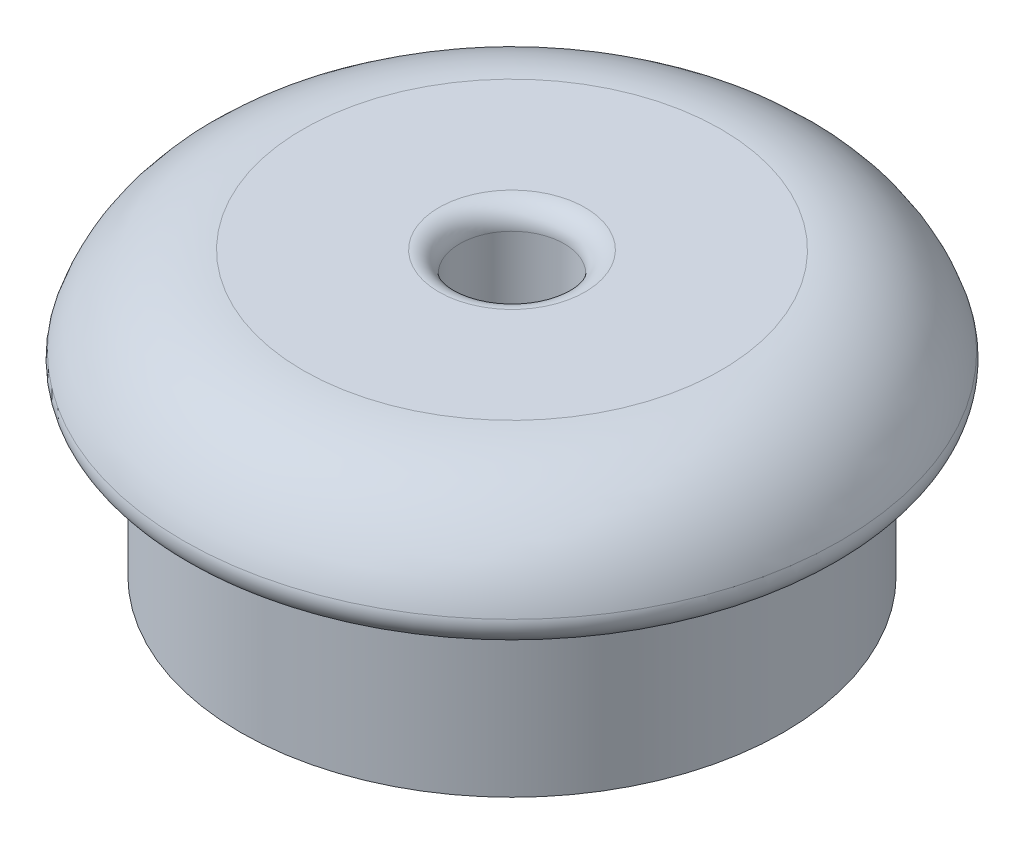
ISO-10303-21;
HEADER;
FILE_DESCRIPTION(('STEP AP214'),'2;1');
FILE_NAME('part.step','',(''),(''),'','','');
FILE_SCHEMA(('AUTOMOTIVE_DESIGN { 1 0 10303 214 1 1 1 1 }'));
ENDSEC;
DATA;
#1=APPLICATION_CONTEXT('core data for automotive mechanical design processes');
#2=APPLICATION_PROTOCOL_DEFINITION('international standard','automotive_design',2000,#1);
#3=PRODUCT_CONTEXT('',#1,'mechanical');
#4=PRODUCT('Part','Part','',(#3));
#5=PRODUCT_RELATED_PRODUCT_CATEGORY('part','',(#4));
#6=PRODUCT_DEFINITION_FORMATION('','',#4);
#7=PRODUCT_DEFINITION_CONTEXT('part definition',#1,'design');
#8=PRODUCT_DEFINITION('design','',#6,#7);
#9=PRODUCT_DEFINITION_SHAPE('','',#8);
#10=(LENGTH_UNIT() NAMED_UNIT(*) SI_UNIT(.MILLI.,.METRE.));
#11=(NAMED_UNIT(*) PLANE_ANGLE_UNIT() SI_UNIT($,.RADIAN.));
#12=(NAMED_UNIT(*) SI_UNIT($,.STERADIAN.) SOLID_ANGLE_UNIT());
#13=UNCERTAINTY_MEASURE_WITH_UNIT(LENGTH_MEASURE(1.E-05),#10,'distance_accuracy_value','');
#14=(GEOMETRIC_REPRESENTATION_CONTEXT(3) GLOBAL_UNCERTAINTY_ASSIGNED_CONTEXT((#13)) GLOBAL_UNIT_ASSIGNED_CONTEXT((#10,
#11,#12)) REPRESENTATION_CONTEXT('',''));
#15=CARTESIAN_POINT('',(0.,0.,0.));
#16=DIRECTION('',(0.,0.,1.));
#17=DIRECTION('',(1.,0.,0.));
#18=AXIS2_PLACEMENT_3D('',#15,#16,#17);
#19=CARTESIAN_POINT('',(0.,0.,0.));
#20=DIRECTION('',(0.,-1.,0.));
#21=DIRECTION('',(0.,0.,-1.));
#22=AXIS2_PLACEMENT_3D('',#19,#20,#21);
#23=PLANE('',#22);
#24=CARTESIAN_POINT('',(0.,0.,0.));
#25=DIRECTION('',(0.,-1.,0.));
#26=DIRECTION('',(0.,0.,-1.));
#27=AXIS2_PLACEMENT_3D('',#24,#25,#26);
#28=CIRCLE('',#27,7.112);
#29=CARTESIAN_POINT('',(0.,0.,-7.112));
#30=VERTEX_POINT('',#29);
#31=EDGE_CURVE('E10',#30,#30,#28,.F.);
#32=ORIENTED_EDGE('',*,*,#31,.T.);
#33=EDGE_LOOP('',(#32));
#34=FACE_BOUND('',#33,.T.);
#35=CARTESIAN_POINT('',(0.,0.,0.));
#36=DIRECTION('',(0.,-1.,0.));
#37=DIRECTION('',(0.,0.,-1.));
#38=AXIS2_PLACEMENT_3D('',#35,#36,#37);
#39=CIRCLE('',#38,7.50300557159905);
#40=CARTESIAN_POINT('',(0.,0.,-7.50300557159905));
#41=VERTEX_POINT('',#40);
#42=EDGE_CURVE('E63',#41,#41,#39,.T.);
#43=ORIENTED_EDGE('',*,*,#42,.T.);
#44=EDGE_LOOP('',(#43));
#45=FACE_BOUND('',#44,.T.);
#46=ADVANCED_FACE('F26',(#34,#45),#23,.T.);
#47=CARTESIAN_POINT('',(0.,0.508,0.));
#48=DIRECTION('',(0.,-1.,0.));
#49=DIRECTION('',(0.,0.,-1.));
#50=AXIS2_PLACEMENT_3D('',#47,#48,#49);
#51=TOROIDAL_SURFACE('',#50,7.50300557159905,0.507999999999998);
#52=CARTESIAN_POINT('',(0.,0.660399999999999,0.));
#53=DIRECTION('',(0.,-1.,0.));
#54=DIRECTION('',(0.,0.,-1.));
#55=AXIS2_PLACEMENT_3D('',#52,#53,#54);
#56=CIRCLE('',#55,7.98760668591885);
#57=CARTESIAN_POINT('',(0.,0.660399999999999,-7.98760668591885));
#58=VERTEX_POINT('',#57);
#59=EDGE_CURVE('E66',#58,#58,#56,.T.);
#60=ORIENTED_EDGE('',*,*,#59,.T.);
#61=EDGE_LOOP('',(#60));
#62=FACE_BOUND('',#61,.T.);
#63=ORIENTED_EDGE('',*,*,#42,.F.);
#64=EDGE_LOOP('',(#63));
#65=FACE_BOUND('',#64,.T.);
#66=ADVANCED_FACE('F102',(#62,#65),#51,.T.);
#67=CARTESIAN_POINT('',(0.,-0.253999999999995,0.));
#68=DIRECTION('',(0.,-1.,0.));
#69=DIRECTION('',(0.,0.,-1.));
#70=AXIS2_PLACEMENT_3D('',#67,#68,#69);
#71=TOROIDAL_SURFACE('',#70,5.08,3.048);
#72=CARTESIAN_POINT('',(0.,2.794,0.));
#73=DIRECTION('',(0.,-1.,0.));
#74=DIRECTION('',(0.,0.,-1.));
#75=AXIS2_PLACEMENT_3D('',#72,#73,#74);
#76=CIRCLE('',#75,5.08);
#77=CARTESIAN_POINT('',(0.,2.794,-5.08));
#78=VERTEX_POINT('',#77);
#79=EDGE_CURVE('E69',#78,#78,#76,.T.);
#80=ORIENTED_EDGE('',*,*,#79,.T.);
#81=EDGE_LOOP('',(#80));
#82=FACE_BOUND('',#81,.T.);
#83=ORIENTED_EDGE('',*,*,#59,.F.);
#84=EDGE_LOOP('',(#83));
#85=FACE_BOUND('',#84,.T.);
#86=ADVANCED_FACE('F107',(#82,#85),#71,.T.);
#87=CARTESIAN_POINT('',(5.08,2.794,0.));
#88=DIRECTION('',(0.,1.,0.));
#89=DIRECTION('',(0.,0.,1.));
#90=AXIS2_PLACEMENT_3D('',#87,#88,#89);
#91=PLANE('',#90);
#92=CARTESIAN_POINT('',(0.,2.794,0.));
#93=DIRECTION('',(0.,1.,0.));
#94=DIRECTION('',(0.,0.,1.));
#95=AXIS2_PLACEMENT_3D('',#92,#93,#94);
#96=CIRCLE('',#95,1.778);
#97=CARTESIAN_POINT('',(0.,2.794,1.778));
#98=VERTEX_POINT('',#97);
#99=EDGE_CURVE('E51',#98,#98,#96,.F.);
#100=ORIENTED_EDGE('',*,*,#99,.T.);
#101=EDGE_LOOP('',(#100));
#102=FACE_BOUND('',#101,.T.);
#103=ORIENTED_EDGE('',*,*,#79,.F.);
#104=EDGE_LOOP('',(#103));
#105=FACE_BOUND('',#104,.T.);
#106=ADVANCED_FACE('F115',(#102,#105),#91,.T.);
#107=CARTESIAN_POINT('',(0.,-4.064,0.));
#108=DIRECTION('',(0.,1.,0.));
#109=DIRECTION('',(0.,0.,1.));
#110=AXIS2_PLACEMENT_3D('',#107,#108,#109);
#111=CYLINDRICAL_SURFACE('',#110,6.604);
#112=CARTESIAN_POINT('',(0.,-0.508,0.));
#113=DIRECTION('',(0.,-1.,0.));
#114=DIRECTION('',(0.,0.,-1.));
#115=AXIS2_PLACEMENT_3D('',#112,#113,#114);
#116=CIRCLE('',#115,6.604);
#117=CARTESIAN_POINT('',(0.,-0.508,-6.604));
#118=VERTEX_POINT('',#117);
#119=EDGE_CURVE('E32',#118,#118,#116,.T.);
#120=ORIENTED_EDGE('',*,*,#119,.T.);
#121=EDGE_LOOP('',(#120));
#122=FACE_BOUND('',#121,.T.);
#123=CARTESIAN_POINT('',(0.,-4.064,0.));
#124=DIRECTION('',(0.,-1.,0.));
#125=DIRECTION('',(0.,0.,-1.));
#126=AXIS2_PLACEMENT_3D('',#123,#124,#125);
#127=CIRCLE('',#126,6.604);
#128=CARTESIAN_POINT('',(0.,-4.064,-6.604));
#129=VERTEX_POINT('',#128);
#130=EDGE_CURVE('E72',#129,#129,#127,.T.);
#131=ORIENTED_EDGE('',*,*,#130,.F.);
#132=EDGE_LOOP('',(#131));
#133=FACE_BOUND('',#132,.T.);
#134=ADVANCED_FACE('F120',(#122,#133),#111,.T.);
#135=CARTESIAN_POINT('',(0.,-4.064,0.));
#136=DIRECTION('',(0.,-1.,0.));
#137=DIRECTION('',(0.,0.,-1.));
#138=AXIS2_PLACEMENT_3D('',#135,#136,#137);
#139=PLANE('',#138);
#140=CARTESIAN_POINT('',(0.,-4.064,0.));
#141=DIRECTION('',(0.,-1.,0.));
#142=DIRECTION('',(0.,0.,-1.));
#143=AXIS2_PLACEMENT_3D('',#140,#141,#142);
#144=CIRCLE('',#143,5.334);
#145=CARTESIAN_POINT('',(0.,-4.064,-5.334));
#146=VERTEX_POINT('',#145);
#147=EDGE_CURVE('E75',#146,#146,#144,.T.);
#148=ORIENTED_EDGE('',*,*,#147,.F.);
#149=EDGE_LOOP('',(#148));
#150=FACE_BOUND('',#149,.T.);
#151=ORIENTED_EDGE('',*,*,#130,.T.);
#152=EDGE_LOOP('',(#151));
#153=FACE_BOUND('',#152,.T.);
#154=ADVANCED_FACE('F96',(#150,#153),#139,.T.);
#155=CARTESIAN_POINT('',(0.,0.,0.));
#156=DIRECTION('',(0.,1.,0.));
#157=DIRECTION('',(0.,0.,1.));
#158=AXIS2_PLACEMENT_3D('',#155,#156,#157);
#159=PLANE('',#158);
#160=CARTESIAN_POINT('',(0.,0.,0.));
#161=DIRECTION('',(0.,1.,0.));
#162=DIRECTION('',(0.,0.,1.));
#163=AXIS2_PLACEMENT_3D('',#160,#161,#162);
#164=CIRCLE('',#163,4.826);
#165=CARTESIAN_POINT('',(0.,0.,4.826));
#166=VERTEX_POINT('',#165);
#167=EDGE_CURVE('E45',#166,#166,#164,.F.);
#168=ORIENTED_EDGE('',*,*,#167,.T.);
#169=EDGE_LOOP('',(#168));
#170=FACE_BOUND('',#169,.T.);
#171=CARTESIAN_POINT('',(0.,0.,0.));
#172=DIRECTION('',(0.,1.,0.));
#173=DIRECTION('',(0.,0.,1.));
#174=AXIS2_PLACEMENT_3D('',#171,#172,#173);
#175=CIRCLE('',#174,3.048);
#176=CARTESIAN_POINT('',(0.,0.,3.048));
#177=VERTEX_POINT('',#176);
#178=EDGE_CURVE('E48',#177,#177,#175,.T.);
#179=ORIENTED_EDGE('',*,*,#178,.T.);
#180=EDGE_LOOP('',(#179));
#181=FACE_BOUND('',#180,.T.);
#182=ADVANCED_FACE('F97',(#170,#181),#159,.F.);
#183=CARTESIAN_POINT('',(0.,15.0868302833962,0.));
#184=DIRECTION('',(0.,-1.,0.));
#185=DIRECTION('',(0.,0.,-1.));
#186=AXIS2_PLACEMENT_3D('',#183,#184,#185);
#187=CYLINDRICAL_SURFACE('',#186,5.334);
#188=CARTESIAN_POINT('',(0.,-0.508,0.));
#189=DIRECTION('',(0.,1.,0.));
#190=DIRECTION('',(0.,0.,1.));
#191=AXIS2_PLACEMENT_3D('',#188,#189,#190);
#192=CIRCLE('',#191,5.334);
#193=CARTESIAN_POINT('',(0.,-0.508000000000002,-5.334));
#194=VERTEX_POINT('',#193);
#195=EDGE_CURVE('E40',#194,#194,#192,.T.);
#196=CARTESIAN_POINT('',(0.,-0.508000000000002,-5.334));
#197=CARTESIAN_POINT('',(0.,-0.545041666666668,-5.334));
#198=CARTESIAN_POINT('',(0.,-0.582083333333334,-5.334));
#199=CARTESIAN_POINT('',(0.,-0.656166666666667,-5.334));
#200=CARTESIAN_POINT('',(0.,-0.693208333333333,-5.334));
#201=CARTESIAN_POINT('',(0.,-0.767291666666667,-5.334));
#202=CARTESIAN_POINT('',(0.,-0.804333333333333,-5.334));
#203=CARTESIAN_POINT('',(0.,-0.878416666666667,-5.334));
#204=CARTESIAN_POINT('',(0.,-0.915458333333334,-5.334));
#205=CARTESIAN_POINT('',(0.,-0.989541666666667,-5.334));
#206=CARTESIAN_POINT('',(0.,-1.02658333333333,-5.334));
#207=CARTESIAN_POINT('',(0.,-1.10066666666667,-5.334));
#208=CARTESIAN_POINT('',(0.,-1.13770833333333,-5.334));
#209=CARTESIAN_POINT('',(0.,-1.21179166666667,-5.334));
#210=CARTESIAN_POINT('',(0.,-1.24883333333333,-5.334));
#211=CARTESIAN_POINT('',(0.,-1.32291666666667,-5.334));
#212=CARTESIAN_POINT('',(0.,-1.35995833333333,-5.334));
#213=CARTESIAN_POINT('',(0.,-1.43404166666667,-5.334));
#214=CARTESIAN_POINT('',(0.,-1.47108333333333,-5.334));
#215=CARTESIAN_POINT('',(0.,-1.54516666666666,-5.334));
#216=CARTESIAN_POINT('',(0.,-1.58220833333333,-5.334));
#217=CARTESIAN_POINT('',(0.,-1.65629166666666,-5.334));
#218=CARTESIAN_POINT('',(0.,-1.69333333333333,-5.334));
#219=CARTESIAN_POINT('',(0.,-1.76741666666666,-5.334));
#220=CARTESIAN_POINT('',(0.,-1.80445833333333,-5.334));
#221=CARTESIAN_POINT('',(0.,-1.87854166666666,-5.334));
#222=CARTESIAN_POINT('',(0.,-1.91558333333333,-5.334));
#223=CARTESIAN_POINT('',(0.,-1.98966666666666,-5.334));
#224=CARTESIAN_POINT('',(0.,-2.02670833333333,-5.334));
#225=CARTESIAN_POINT('',(0.,-2.10079166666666,-5.334));
#226=CARTESIAN_POINT('',(0.,-2.13783333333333,-5.334));
#227=CARTESIAN_POINT('',(0.,-2.21191666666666,-5.334));
#228=CARTESIAN_POINT('',(0.,-2.24895833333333,-5.334));
#229=CARTESIAN_POINT('',(0.,-2.32304166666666,-5.334));
#230=CARTESIAN_POINT('',(0.,-2.36008333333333,-5.334));
#231=CARTESIAN_POINT('',(0.,-2.43416666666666,-5.334));
#232=CARTESIAN_POINT('',(0.,-2.47120833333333,-5.334));
#233=CARTESIAN_POINT('',(0.,-2.54529166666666,-5.334));
#234=CARTESIAN_POINT('',(0.,-2.58233333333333,-5.334));
#235=CARTESIAN_POINT('',(0.,-2.65641666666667,-5.334));
#236=CARTESIAN_POINT('',(0.,-2.69345833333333,-5.334));
#237=CARTESIAN_POINT('',(0.,-2.76754166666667,-5.334));
#238=CARTESIAN_POINT('',(0.,-2.80458333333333,-5.334));
#239=CARTESIAN_POINT('',(0.,-2.87866666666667,-5.334));
#240=CARTESIAN_POINT('',(0.,-2.91570833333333,-5.334));
#241=CARTESIAN_POINT('',(0.,-2.98979166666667,-5.334));
#242=CARTESIAN_POINT('',(0.,-3.02683333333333,-5.334));
#243=CARTESIAN_POINT('',(0.,-3.10091666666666,-5.334));
#244=CARTESIAN_POINT('',(0.,-3.13795833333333,-5.334));
#245=CARTESIAN_POINT('',(0.,-3.21204166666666,-5.334));
#246=CARTESIAN_POINT('',(0.,-3.24908333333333,-5.334));
#247=CARTESIAN_POINT('',(0.,-3.32316666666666,-5.334));
#248=CARTESIAN_POINT('',(0.,-3.36020833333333,-5.334));
#249=CARTESIAN_POINT('',(0.,-3.43429166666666,-5.334));
#250=CARTESIAN_POINT('',(0.,-3.47133333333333,-5.334));
#251=CARTESIAN_POINT('',(0.,-3.54541666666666,-5.334));
#252=CARTESIAN_POINT('',(0.,-3.58245833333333,-5.334));
#253=CARTESIAN_POINT('',(0.,-3.65654166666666,-5.334));
#254=CARTESIAN_POINT('',(0.,-3.69358333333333,-5.334));
#255=CARTESIAN_POINT('',(0.,-3.76766666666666,-5.334));
#256=CARTESIAN_POINT('',(0.,-3.80470833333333,-5.334));
#257=CARTESIAN_POINT('',(0.,-3.87879166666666,-5.334));
#258=CARTESIAN_POINT('',(0.,-3.91583333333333,-5.334));
#259=CARTESIAN_POINT('',(0.,-3.98991666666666,-5.334));
#260=CARTESIAN_POINT('',(0.,-4.02695833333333,-5.334));
#261=CARTESIAN_POINT('',(0.,-4.064,-5.334));
#262=B_SPLINE_CURVE_WITH_KNOTS('',3,(#196,#197,#198,#199,#200,#201,#202,#203,#204,#205,#206,
#207,#208,#209,#210,#211,#212,#213,#214,#215,#216,#217,#218,#219,#220,#221,#222,#223,#224,#225,
#226,#227,#228,#229,#230,#231,#232,#233,#234,#235,#236,#237,#238,#239,#240,#241,#242,#243,#244,
#245,#246,#247,#248,#249,#250,#251,#252,#253,#254,#255,#256,#257,#258,#259,#260,#261),
.UNSPECIFIED.,.F.,.F.,(4,2,2,2,2,2,2,2,2,2,2,2,2,2,2,2,2,2,2,2,2,2,2,2,2,2,2,2,2,2,2,2,4),(0.,
0.111124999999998,0.222249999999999,0.333374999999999,0.444499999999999,0.555624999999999,
0.666749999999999,0.777874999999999,0.888999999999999,1.000125,1.11125,1.222375,1.3335,1.444625,
1.55575,1.666875,1.778,1.889125,2.00025,2.111375,2.2225,2.333625,2.44475,2.555875,
2.66699999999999,2.778125,2.88924999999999,3.00037499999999,3.11149999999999,3.22262499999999,
3.33374999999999,3.44487499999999,3.55599999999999),.UNSPECIFIED.);
#263=EDGE_CURVE('BSEAM86',#194,#146,#262,.T.);
#264=ORIENTED_EDGE('',*,*,#195,.T.);
#265=ORIENTED_EDGE('',*,*,#147,.T.);
#266=ORIENTED_EDGE('',*,*,#263,.T.);
#267=ORIENTED_EDGE('',*,*,#263,.F.);
#268=EDGE_LOOP('',(#264,#266,#265,#267));
#269=FACE_BOUND('',#268,.T.);
#270=ADVANCED_FACE('F86',(#269),#187,.F.);
#271=CARTESIAN_POINT('',(0.,15.0868302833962,0.));
#272=DIRECTION('',(0.,-1.,0.));
#273=DIRECTION('',(0.,0.,-1.));
#274=AXIS2_PLACEMENT_3D('',#271,#272,#273);
#275=CYLINDRICAL_SURFACE('',#274,2.54);
#276=CARTESIAN_POINT('',(0.,-0.507999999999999,0.));
#277=DIRECTION('',(0.,1.,0.));
#278=DIRECTION('',(0.,0.,1.));
#279=AXIS2_PLACEMENT_3D('',#276,#277,#278);
#280=CIRCLE('',#279,2.54);
#281=CARTESIAN_POINT('',(0.,-0.507999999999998,-2.54));
#282=VERTEX_POINT('',#281);
#283=EDGE_CURVE('E36',#282,#282,#280,.F.);
#284=CARTESIAN_POINT('',(0.,-4.064,0.));
#285=DIRECTION('',(0.,-1.,0.));
#286=DIRECTION('',(0.,0.,-1.));
#287=AXIS2_PLACEMENT_3D('',#284,#285,#286);
#288=CIRCLE('',#287,2.54);
#289=CARTESIAN_POINT('',(0.,-4.064,-2.54));
#290=VERTEX_POINT('',#289);
#291=EDGE_CURVE('E78',#290,#290,#288,.T.);
#292=CARTESIAN_POINT('',(0.,-0.507999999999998,-2.54));
#293=CARTESIAN_POINT('',(0.,-0.545041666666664,-2.54));
#294=CARTESIAN_POINT('',(0.,-0.58208333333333,-2.54));
#295=CARTESIAN_POINT('',(0.,-0.656166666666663,-2.54));
#296=CARTESIAN_POINT('',(0.,-0.69320833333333,-2.54));
#297=CARTESIAN_POINT('',(0.,-0.767291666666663,-2.54));
#298=CARTESIAN_POINT('',(0.,-0.80433333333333,-2.54));
#299=CARTESIAN_POINT('',(0.,-0.878416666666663,-2.54));
#300=CARTESIAN_POINT('',(0.,-0.91545833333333,-2.54));
#301=CARTESIAN_POINT('',(0.,-0.989541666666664,-2.54));
#302=CARTESIAN_POINT('',(0.,-1.02658333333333,-2.54));
#303=CARTESIAN_POINT('',(0.,-1.10066666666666,-2.54));
#304=CARTESIAN_POINT('',(0.,-1.13770833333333,-2.54));
#305=CARTESIAN_POINT('',(0.,-1.21179166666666,-2.54));
#306=CARTESIAN_POINT('',(0.,-1.24883333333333,-2.54));
#307=CARTESIAN_POINT('',(0.,-1.32291666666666,-2.54));
#308=CARTESIAN_POINT('',(0.,-1.35995833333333,-2.54));
#309=CARTESIAN_POINT('',(0.,-1.43404166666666,-2.54));
#310=CARTESIAN_POINT('',(0.,-1.47108333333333,-2.54));
#311=CARTESIAN_POINT('',(0.,-1.54516666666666,-2.54));
#312=CARTESIAN_POINT('',(0.,-1.58220833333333,-2.54));
#313=CARTESIAN_POINT('',(0.,-1.65629166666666,-2.54));
#314=CARTESIAN_POINT('',(0.,-1.69333333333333,-2.54));
#315=CARTESIAN_POINT('',(0.,-1.76741666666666,-2.54));
#316=CARTESIAN_POINT('',(0.,-1.80445833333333,-2.54));
#317=CARTESIAN_POINT('',(0.,-1.87854166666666,-2.54));
#318=CARTESIAN_POINT('',(0.,-1.91558333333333,-2.54));
#319=CARTESIAN_POINT('',(0.,-1.98966666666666,-2.54));
#320=CARTESIAN_POINT('',(0.,-2.02670833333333,-2.54));
#321=CARTESIAN_POINT('',(0.,-2.10079166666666,-2.54));
#322=CARTESIAN_POINT('',(0.,-2.13783333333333,-2.54));
#323=CARTESIAN_POINT('',(0.,-2.21191666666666,-2.54));
#324=CARTESIAN_POINT('',(0.,-2.24895833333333,-2.54));
#325=CARTESIAN_POINT('',(0.,-2.32304166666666,-2.54));
#326=CARTESIAN_POINT('',(0.,-2.36008333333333,-2.54));
#327=CARTESIAN_POINT('',(0.,-2.43416666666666,-2.54));
#328=CARTESIAN_POINT('',(0.,-2.47120833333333,-2.54));
#329=CARTESIAN_POINT('',(0.,-2.54529166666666,-2.54));
#330=CARTESIAN_POINT('',(0.,-2.58233333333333,-2.54));
#331=CARTESIAN_POINT('',(0.,-2.65641666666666,-2.54));
#332=CARTESIAN_POINT('',(0.,-2.69345833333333,-2.54));
#333=CARTESIAN_POINT('',(0.,-2.76754166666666,-2.54));
#334=CARTESIAN_POINT('',(0.,-2.80458333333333,-2.54));
#335=CARTESIAN_POINT('',(0.,-2.87866666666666,-2.54));
#336=CARTESIAN_POINT('',(0.,-2.91570833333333,-2.54));
#337=CARTESIAN_POINT('',(0.,-2.98979166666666,-2.54));
#338=CARTESIAN_POINT('',(0.,-3.02683333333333,-2.54));
#339=CARTESIAN_POINT('',(0.,-3.10091666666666,-2.54));
#340=CARTESIAN_POINT('',(0.,-3.13795833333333,-2.54));
#341=CARTESIAN_POINT('',(0.,-3.21204166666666,-2.54));
#342=CARTESIAN_POINT('',(0.,-3.24908333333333,-2.54));
#343=CARTESIAN_POINT('',(0.,-3.32316666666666,-2.54));
#344=CARTESIAN_POINT('',(0.,-3.36020833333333,-2.54));
#345=CARTESIAN_POINT('',(0.,-3.43429166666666,-2.54));
#346=CARTESIAN_POINT('',(0.,-3.47133333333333,-2.54));
#347=CARTESIAN_POINT('',(0.,-3.54541666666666,-2.54));
#348=CARTESIAN_POINT('',(0.,-3.58245833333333,-2.54));
#349=CARTESIAN_POINT('',(0.,-3.65654166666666,-2.54));
#350=CARTESIAN_POINT('',(0.,-3.69358333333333,-2.54));
#351=CARTESIAN_POINT('',(0.,-3.76766666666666,-2.54));
#352=CARTESIAN_POINT('',(0.,-3.80470833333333,-2.54));
#353=CARTESIAN_POINT('',(0.,-3.87879166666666,-2.54));
#354=CARTESIAN_POINT('',(0.,-3.91583333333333,-2.54));
#355=CARTESIAN_POINT('',(0.,-3.98991666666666,-2.54));
#356=CARTESIAN_POINT('',(0.,-4.02695833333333,-2.54));
#357=CARTESIAN_POINT('',(0.,-4.064,-2.54));
#358=B_SPLINE_CURVE_WITH_KNOTS('',3,(#292,#293,#294,#295,#296,#297,#298,#299,#300,#301,#302,
#303,#304,#305,#306,#307,#308,#309,#310,#311,#312,#313,#314,#315,#316,#317,#318,#319,#320,#321,
#322,#323,#324,#325,#326,#327,#328,#329,#330,#331,#332,#333,#334,#335,#336,#337,#338,#339,#340,
#341,#342,#343,#344,#345,#346,#347,#348,#349,#350,#351,#352,#353,#354,#355,#356,#357),
.UNSPECIFIED.,.F.,.F.,(4,2,2,2,2,2,2,2,2,2,2,2,2,2,2,2,2,2,2,2,2,2,2,2,2,2,2,2,2,2,2,2,4),(0.,
0.111124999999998,0.222249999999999,0.333374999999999,0.444499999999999,0.555624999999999,
0.666749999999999,0.777874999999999,0.888999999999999,1.000125,1.11125,1.222375,1.3335,1.444625,
1.55575,1.666875,1.778,1.889125,2.00025,2.111375,2.2225,2.333625,2.44475,2.555875,2.667,
2.778125,2.88925,3.000375,3.1115,3.222625,3.33375,3.444875,3.556),.UNSPECIFIED.);
#359=EDGE_CURVE('BSEAM84',#282,#290,#358,.T.);
#360=ORIENTED_EDGE('',*,*,#283,.T.);
#361=ORIENTED_EDGE('',*,*,#291,.F.);
#362=ORIENTED_EDGE('',*,*,#359,.T.);
#363=ORIENTED_EDGE('',*,*,#359,.F.);
#364=EDGE_LOOP('',(#360,#362,#361,#363));
#365=FACE_BOUND('',#364,.T.);
#366=ADVANCED_FACE('F84',(#365),#275,.T.);
#367=ORIENTED_EDGE('',*,*,#291,.T.);
#368=EDGE_LOOP('',(#367));
#369=FACE_BOUND('',#368,.T.);
#370=ADVANCED_FACE('F82',(#369),#139,.T.);
#371=CARTESIAN_POINT('',(0.,-2.794,0.));
#372=DIRECTION('',(0.,-1.,0.));
#373=DIRECTION('',(0.,0.,-1.));
#374=AXIS2_PLACEMENT_3D('',#371,#372,#373);
#375=PLANE('',#374);
#376=CARTESIAN_POINT('',(0.,-2.794,0.));
#377=DIRECTION('',(0.,-1.,0.));
#378=DIRECTION('',(0.,0.,-1.));
#379=AXIS2_PLACEMENT_3D('',#376,#377,#378);
#380=CIRCLE('',#379,0.762);
#381=CARTESIAN_POINT('',(0.,-2.794,-0.762));
#382=VERTEX_POINT('',#381);
#383=EDGE_CURVE('E60',#382,#382,#380,.F.);
#384=ORIENTED_EDGE('',*,*,#383,.T.);
#385=EDGE_LOOP('',(#384));
#386=FACE_BOUND('',#385,.T.);
#387=ADVANCED_FACE('F94',(#386),#375,.F.);
#388=CARTESIAN_POINT('',(0.,-7.65610244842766,0.));
#389=DIRECTION('',(0.,1.,0.));
#390=DIRECTION('',(0.,0.,1.));
#391=AXIS2_PLACEMENT_3D('',#388,#389,#390);
#392=CYLINDRICAL_SURFACE('',#391,1.27);
#393=CARTESIAN_POINT('',(0.,-2.286,0.));
#394=DIRECTION('',(0.,-1.,0.));
#395=DIRECTION('',(0.,0.,-1.));
#396=AXIS2_PLACEMENT_3D('',#393,#394,#395);
#397=CIRCLE('',#396,1.27);
#398=CARTESIAN_POINT('',(0.,-2.286,-1.27));
#399=VERTEX_POINT('',#398);
#400=EDGE_CURVE('E54',#399,#399,#397,.T.);
#401=ORIENTED_EDGE('',*,*,#400,.T.);
#402=EDGE_LOOP('',(#401));
#403=FACE_BOUND('',#402,.T.);
#404=CARTESIAN_POINT('',(0.,2.286,0.));
#405=DIRECTION('',(0.,1.,0.));
#406=DIRECTION('',(0.,0.,1.));
#407=AXIS2_PLACEMENT_3D('',#404,#405,#406);
#408=CIRCLE('',#407,1.27);
#409=CARTESIAN_POINT('',(0.,2.286,1.27));
#410=VERTEX_POINT('',#409);
#411=EDGE_CURVE('E57',#410,#410,#408,.T.);
#412=ORIENTED_EDGE('',*,*,#411,.T.);
#413=EDGE_LOOP('',(#412));
#414=FACE_BOUND('',#413,.T.);
#415=ADVANCED_FACE('F157',(#403,#414),#392,.F.);
#416=CARTESIAN_POINT('',(0.,-2.286,0.));
#417=DIRECTION('',(0.,-1.,0.));
#418=DIRECTION('',(0.,0.,-1.));
#419=AXIS2_PLACEMENT_3D('',#416,#417,#418);
#420=TOROIDAL_SURFACE('',#419,0.762,0.508);
#421=ORIENTED_EDGE('',*,*,#400,.F.);
#422=EDGE_LOOP('',(#421));
#423=FACE_BOUND('',#422,.T.);
#424=ORIENTED_EDGE('',*,*,#383,.F.);
#425=EDGE_LOOP('',(#424));
#426=FACE_BOUND('',#425,.T.);
#427=ADVANCED_FACE('F153',(#423,#426),#420,.F.);
#428=CARTESIAN_POINT('',(0.,2.286,0.));
#429=DIRECTION('',(0.,1.,0.));
#430=DIRECTION('',(0.,0.,1.));
#431=AXIS2_PLACEMENT_3D('',#428,#429,#430);
#432=TOROIDAL_SURFACE('',#431,1.778,0.508);
#433=ORIENTED_EDGE('',*,*,#99,.F.);
#434=EDGE_LOOP('',(#433));
#435=FACE_BOUND('',#434,.T.);
#436=ORIENTED_EDGE('',*,*,#411,.F.);
#437=EDGE_LOOP('',(#436));
#438=FACE_BOUND('',#437,.T.);
#439=ADVANCED_FACE('F147',(#435,#438),#432,.T.);
#440=CARTESIAN_POINT('',(0.,-0.508,0.));
#441=DIRECTION('',(0.,1.,0.));
#442=DIRECTION('',(0.,0.,1.));
#443=AXIS2_PLACEMENT_3D('',#440,#441,#442);
#444=TOROIDAL_SURFACE('',#443,4.826,0.508);
#445=ORIENTED_EDGE('',*,*,#195,.F.);
#446=EDGE_LOOP('',(#445));
#447=FACE_BOUND('',#446,.T.);
#448=ORIENTED_EDGE('',*,*,#167,.F.);
#449=EDGE_LOOP('',(#448));
#450=FACE_BOUND('',#449,.T.);
#451=ADVANCED_FACE('F138',(#447,#450),#444,.F.);
#452=CARTESIAN_POINT('',(0.,-0.508,0.));
#453=DIRECTION('',(0.,1.,0.));
#454=DIRECTION('',(0.,0.,1.));
#455=AXIS2_PLACEMENT_3D('',#452,#453,#454);
#456=TOROIDAL_SURFACE('',#455,3.048,0.508);
#457=ORIENTED_EDGE('',*,*,#178,.F.);
#458=EDGE_LOOP('',(#457));
#459=FACE_BOUND('',#458,.T.);
#460=ORIENTED_EDGE('',*,*,#283,.F.);
#461=EDGE_LOOP('',(#460));
#462=FACE_BOUND('',#461,.T.);
#463=ADVANCED_FACE('F134',(#459,#462),#456,.F.);
#464=CARTESIAN_POINT('',(0.,-0.508,0.));
#465=DIRECTION('',(0.,-1.,0.));
#466=DIRECTION('',(0.,0.,-1.));
#467=AXIS2_PLACEMENT_3D('',#464,#465,#466);
#468=TOROIDAL_SURFACE('',#467,7.112,0.508);
#469=ORIENTED_EDGE('',*,*,#31,.F.);
#470=EDGE_LOOP('',(#469));
#471=FACE_BOUND('',#470,.T.);
#472=ORIENTED_EDGE('',*,*,#119,.F.);
#473=EDGE_LOOP('',(#472));
#474=FACE_BOUND('',#473,.T.);
#475=ADVANCED_FACE('F137',(#471,#474),#468,.F.);
#476=CLOSED_SHELL('',(#46,#66,#86,#106,#134,#154,#182,#270,#366,#370,#387,#415,#427,#439,#451,
#463,#475));
#477=MANIFOLD_SOLID_BREP('B2',#476);
#478=ADVANCED_BREP_SHAPE_REPRESENTATION('',(#18,#477),#14);
#479=SHAPE_DEFINITION_REPRESENTATION(#9,#478);
ENDSEC;
END-ISO-10303-21;
